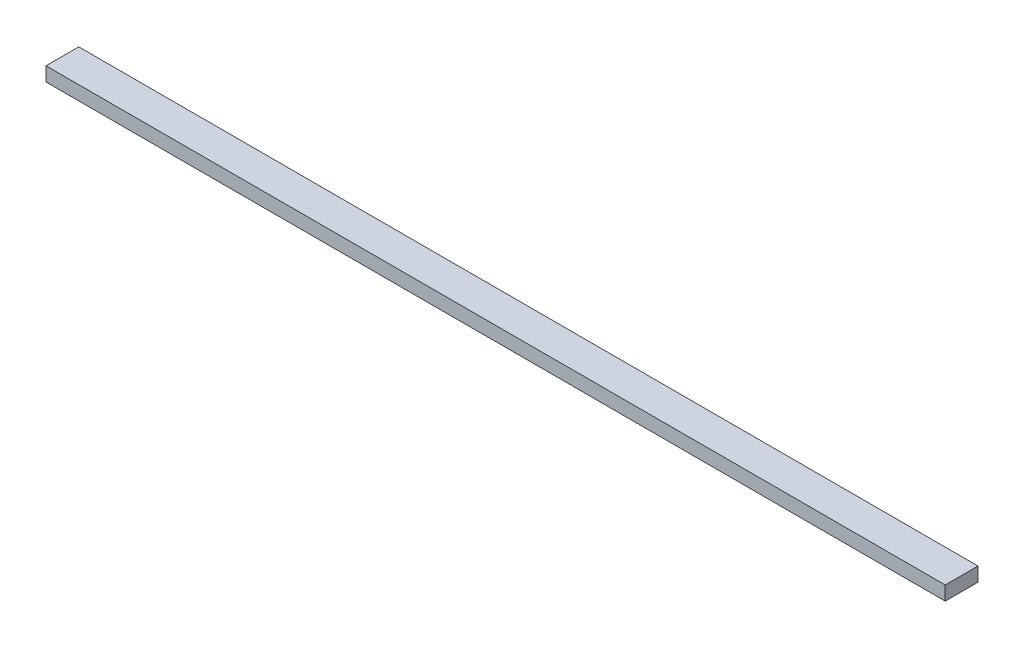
from build123d import *

# Parameters (mm, degrees)
SKETCH2_W           = 2438.4
SKETCH2_H           = 88.9
BOSS_EXTRUDE1_DEPTH = 38.1


with BuildPart() as part:
    # Sketch2 → Boss-Extrude1 (new body)
    with BuildSketch(Plane(origin=(0, 0, 0), x_dir=(1, 0, 0), z_dir=(0, 1, 0))):
        with Locations((1219.2, 44.45)):
            Rectangle(SKETCH2_W, SKETCH2_H)
    extrude(amount=BOSS_EXTRUDE1_DEPTH)


solid = part.part
